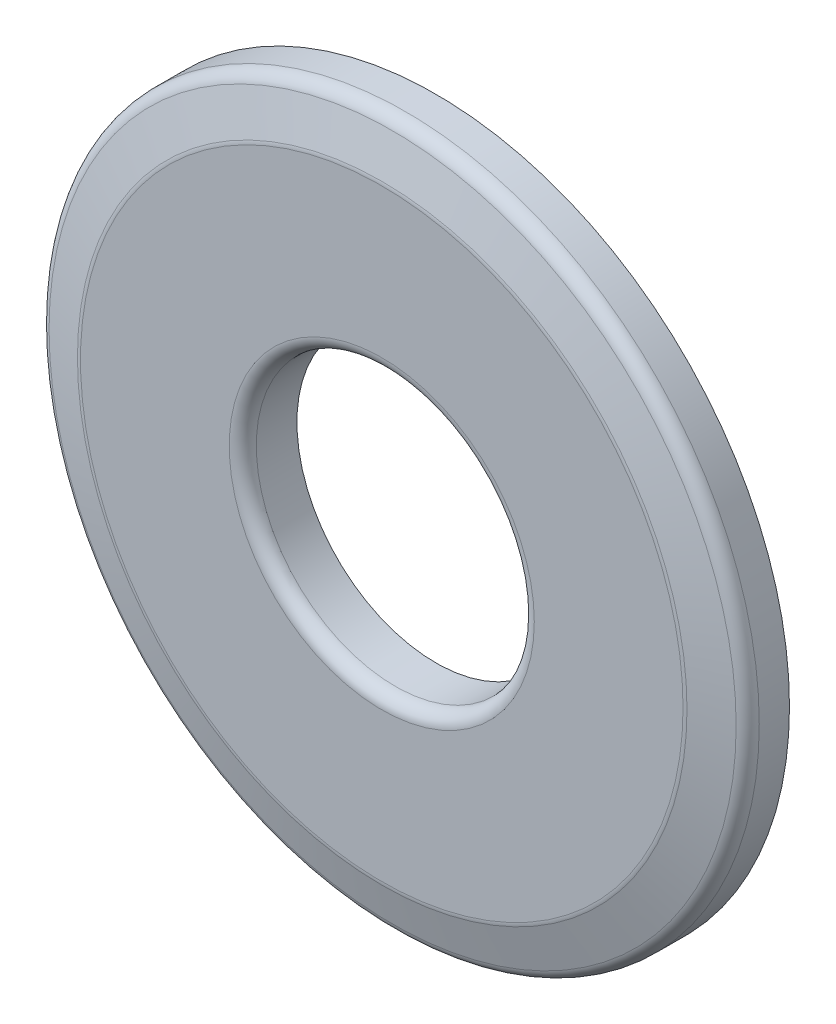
from build123d import *

# Parameters (mm, degrees)
BOSS_EXTRUDE1_DEPTH      = 1.7018
BOSS_EXTRUDE1_DEPTH_BACK = 1.7018
SKETCH3_R                = 22.225
SKETCH3_R_2              = 8.7376
CHAMFER1_SIZE            = 0.8509
CHAMFER1_SIZE2           = 3.175602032
FILLET1_R                = 0.8509


with BuildPart() as part:
    # Sketch3 → Boss-Extrude1 (new, two sides: drawn at the far end of the back side and taken through both)
    with BuildSketch(Plane.XY.offset(-BOSS_EXTRUDE1_DEPTH_BACK)):
        Circle(SKETCH3_R)
        Circle(SKETCH3_R_2, mode=Mode.SUBTRACT)
    extrude(amount=BOSS_EXTRUDE1_DEPTH + BOSS_EXTRUDE1_DEPTH_BACK)

    # Chamfer1
    chamfer1_edges = [part.edges().sort_by_distance(p)[0] for p in [
        (-22.225, 0, 1.7018),
    ]]
    chamfer1_side = [part.faces().sort_by_distance(p)[0] for p in [
        (-22.225, 0, 0.8509),
    ]]
    chamfer(chamfer1_edges, length=CHAMFER1_SIZE, length2=CHAMFER1_SIZE2, reference=chamfer1_side[0])

    # Fillet1
    fillet1_edges = [part.edges().sort_by_distance(p)[0] for p in [
        (-19.049397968, 0, 1.7018),
        (-22.225, 0, 0.8509),
        (-8.7376, 0, 1.7018),
    ]]
    fillet(fillet1_edges, radius=FILLET1_R)


solid = part.part
